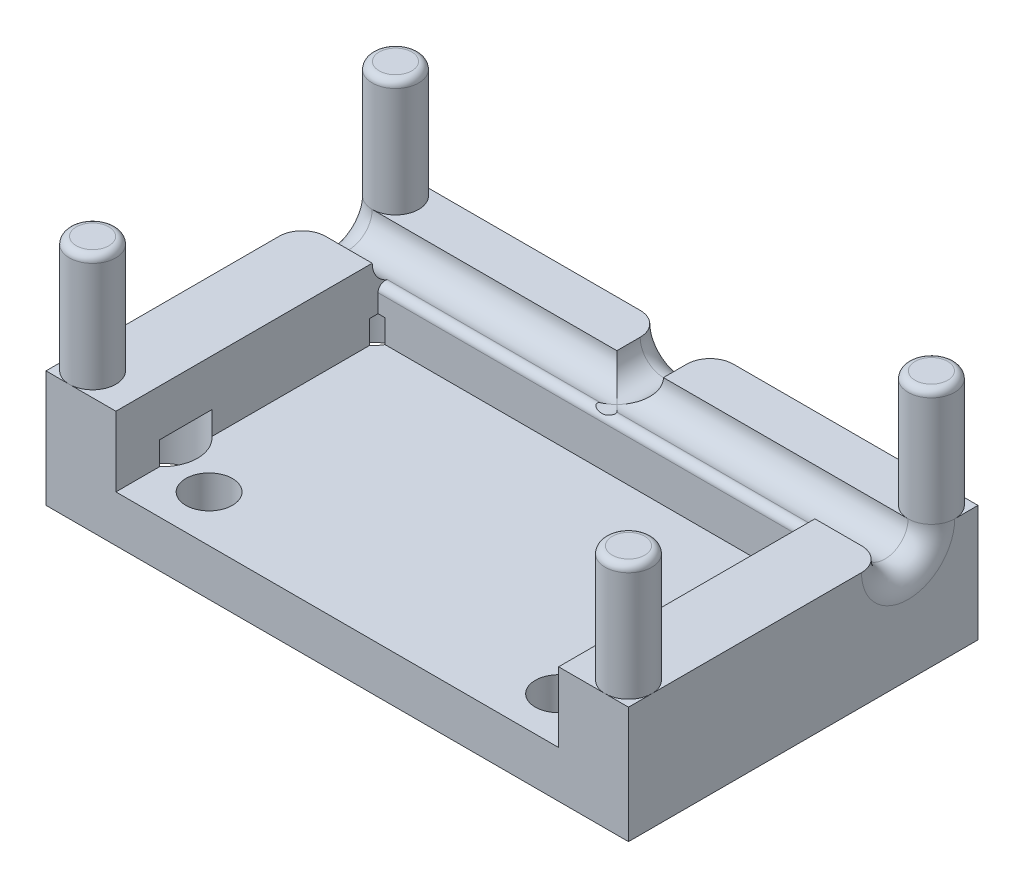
ISO-10303-21;
HEADER;
FILE_DESCRIPTION(('STEP AP214'),'2;1');
FILE_NAME('part.step','',(''),(''),'','','');
FILE_SCHEMA(('AUTOMOTIVE_DESIGN { 1 0 10303 214 1 1 1 1 }'));
ENDSEC;
DATA;
#1=APPLICATION_CONTEXT('core data for automotive mechanical design processes');
#2=APPLICATION_PROTOCOL_DEFINITION('international standard','automotive_design',2000,#1);
#3=PRODUCT_CONTEXT('',#1,'mechanical');
#4=PRODUCT('Part','Part','',(#3));
#5=PRODUCT_RELATED_PRODUCT_CATEGORY('part','',(#4));
#6=PRODUCT_DEFINITION_FORMATION('','',#4);
#7=PRODUCT_DEFINITION_CONTEXT('part definition',#1,'design');
#8=PRODUCT_DEFINITION('design','',#6,#7);
#9=PRODUCT_DEFINITION_SHAPE('','',#8);
#10=(LENGTH_UNIT() NAMED_UNIT(*) SI_UNIT(.MILLI.,.METRE.));
#11=(NAMED_UNIT(*) PLANE_ANGLE_UNIT() SI_UNIT($,.RADIAN.));
#12=(NAMED_UNIT(*) SI_UNIT($,.STERADIAN.) SOLID_ANGLE_UNIT());
#13=UNCERTAINTY_MEASURE_WITH_UNIT(LENGTH_MEASURE(1.E-05),#10,'distance_accuracy_value','');
#14=(GEOMETRIC_REPRESENTATION_CONTEXT(3) GLOBAL_UNCERTAINTY_ASSIGNED_CONTEXT((#13)) GLOBAL_UNIT_ASSIGNED_CONTEXT((#10,
#11,#12)) REPRESENTATION_CONTEXT('',''));
#15=CARTESIAN_POINT('',(0.,0.,0.));
#16=DIRECTION('',(0.,0.,1.));
#17=DIRECTION('',(1.,0.,0.));
#18=AXIS2_PLACEMENT_3D('',#15,#16,#17);
#19=CARTESIAN_POINT('',(0.,5.,0.));
#20=DIRECTION('',(0.,1.,0.));
#21=DIRECTION('',(0.,0.,1.));
#22=AXIS2_PLACEMENT_3D('',#19,#20,#21);
#23=PLANE('',#22);
#24=DIRECTION('',(-1.,0.,0.));
#25=VECTOR('',#24,1.);
#26=CARTESIAN_POINT('',(12.5,5.,-7.5));
#27=LINE('',#26,#25);
#28=CARTESIAN_POINT('',(11.5,5.,-7.5));
#29=VERTEX_POINT('',#28);
#30=CARTESIAN_POINT('',(2.,5.,-7.5));
#31=VERTEX_POINT('',#30);
#32=EDGE_CURVE('E573',#29,#31,#27,.T.);
#33=ORIENTED_EDGE('',*,*,#32,.T.);
#34=CARTESIAN_POINT('',(2.,5.,-6.5));
#35=DIRECTION('',(0.,1.,0.));
#36=DIRECTION('',(0.,0.,1.));
#37=AXIS2_PLACEMENT_3D('',#34,#35,#36);
#38=CIRCLE('',#37,1.);
#39=CARTESIAN_POINT('',(0.999999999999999,5.,-6.5));
#40=VERTEX_POINT('',#39);
#41=EDGE_CURVE('E59',#31,#40,#38,.T.);
#42=ORIENTED_EDGE('',*,*,#41,.T.);
#43=DIRECTION('',(0.,0.,-1.));
#44=VECTOR('',#43,1.);
#45=CARTESIAN_POINT('',(1.,5.,7.5));
#46=LINE('',#45,#44);
#47=CARTESIAN_POINT('',(0.999999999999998,5.,-5.5));
#48=VERTEX_POINT('',#47);
#49=EDGE_CURVE('E706',#48,#40,#46,.T.);
#50=ORIENTED_EDGE('',*,*,#49,.F.);
#51=DIRECTION('',(-1.,0.,0.));
#52=VECTOR('',#51,1.);
#53=CARTESIAN_POINT('',(12.5,5.,-5.5));
#54=LINE('',#53,#52);
#55=CARTESIAN_POINT('',(11.5,5.,-5.5));
#56=VERTEX_POINT('',#55);
#57=EDGE_CURVE('E482',#56,#48,#54,.T.);
#58=ORIENTED_EDGE('',*,*,#57,.F.);
#59=CARTESIAN_POINT('',(11.5,5.,-6.5));
#60=DIRECTION('',(0.,1.,0.));
#61=DIRECTION('',(0.,0.,-1.));
#62=AXIS2_PLACEMENT_3D('',#59,#60,#61);
#63=CIRCLE('',#62,1.);
#64=EDGE_CURVE('E550',#29,#56,#63,.T.);
#65=ORIENTED_EDGE('',*,*,#64,.F.);
#66=EDGE_LOOP('',(#33,#42,#50,#58,#65));
#67=FACE_BOUND('',#66,.T.);
#68=ADVANCED_FACE('F37',(#67),#23,.T.);
#69=CARTESIAN_POINT('',(12.5,5.,-4.5));
#70=DIRECTION('',(-1.,0.,0.));
#71=DIRECTION('',(0.,0.,1.));
#72=AXIS2_PLACEMENT_3D('',#69,#70,#71);
#73=CYLINDRICAL_SURFACE('',#72,1.);
#74=DIRECTION('',(-1.,0.,0.));
#75=VECTOR('',#74,1.);
#76=CARTESIAN_POINT('',(12.5,4.06182223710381,-4.15384615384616));
#77=LINE('',#76,#75);
#78=CARTESIAN_POINT('',(-9.5,4.06182223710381,-4.15384615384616));
#79=VERTEX_POINT('',#78);
#80=CARTESIAN_POINT('',(-0.346153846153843,4.06182223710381,-4.15384615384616));
#81=VERTEX_POINT('',#80);
#82=EDGE_CURVE('E257',#79,#81,#77,.F.);
#83=ORIENTED_EDGE('',*,*,#82,.T.);
#84=CARTESIAN_POINT('',(0.,5.,-4.5));
#85=DIRECTION('',(-0.707106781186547,0.,-0.707106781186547));
#86=DIRECTION('',(-0.707106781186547,0.,0.707106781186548));
#87=AXIS2_PLACEMENT_3D('',#84,#85,#86);
#88=ELLIPSE('',#87,1.41421356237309,1.);
#89=CARTESIAN_POINT('',(0.,4.,-4.5));
#90=VERTEX_POINT('',#89);
#91=EDGE_CURVE('E236',#81,#90,#88,.F.);
#92=ORIENTED_EDGE('',*,*,#91,.T.);
#93=CARTESIAN_POINT('',(0.,5.,-4.5));
#94=DIRECTION('',(-0.707106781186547,0.,0.707106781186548));
#95=DIRECTION('',(-0.707106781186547,0.,-0.707106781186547));
#96=AXIS2_PLACEMENT_3D('',#93,#94,#95);
#97=ELLIPSE('',#96,1.4142135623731,1.);
#98=CARTESIAN_POINT('',(-0.999999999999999,5.,-5.5));
#99=VERTEX_POINT('',#98);
#100=EDGE_CURVE('E703',#90,#99,#97,.F.);
#101=ORIENTED_EDGE('',*,*,#100,.T.);
#102=CARTESIAN_POINT('',(-11.5,5.,-5.5));
#103=VERTEX_POINT('',#102);
#104=EDGE_CURVE('E479',#99,#103,#54,.T.);
#105=ORIENTED_EDGE('',*,*,#104,.T.);
#106=CARTESIAN_POINT('',(-11.5,5.,-4.5));
#107=DIRECTION('',(1.,0.,0.));
#108=DIRECTION('',(0.,0.,-1.));
#109=AXIS2_PLACEMENT_3D('',#106,#107,#108);
#110=CIRCLE('',#109,1.);
#111=CARTESIAN_POINT('',(-11.5,5.,-3.5));
#112=VERTEX_POINT('',#111);
#113=EDGE_CURVE('E478',#103,#112,#110,.F.);
#114=ORIENTED_EDGE('',*,*,#113,.T.);
#115=DIRECTION('',(-1.,0.,0.));
#116=VECTOR('',#115,1.);
#117=CARTESIAN_POINT('',(12.5,5.,-3.5));
#118=LINE('',#117,#116);
#119=CARTESIAN_POINT('',(-9.5,5.,-3.5));
#120=VERTEX_POINT('',#119);
#121=EDGE_CURVE('E466',#112,#120,#118,.F.);
#122=ORIENTED_EDGE('',*,*,#121,.T.);
#123=CARTESIAN_POINT('',(-9.5,5.,-4.5));
#124=DIRECTION('',(-1.,0.,0.));
#125=DIRECTION('',(0.,0.,1.));
#126=AXIS2_PLACEMENT_3D('',#123,#124,#125);
#127=CIRCLE('',#126,1.);
#128=EDGE_CURVE('E476',#120,#79,#127,.F.);
#129=ORIENTED_EDGE('',*,*,#128,.T.);
#130=EDGE_LOOP('',(#83,#92,#101,#105,#114,#122,#129));
#131=FACE_BOUND('',#130,.T.);
#132=ADVANCED_FACE('F359',(#131),#73,.F.);
#133=CARTESIAN_POINT('',(-9.5,2.,7.5));
#134=DIRECTION('',(-1.,0.,0.));
#135=DIRECTION('',(0.,0.,1.));
#136=AXIS2_PLACEMENT_3D('',#133,#134,#135);
#137=PLANE('',#136);
#138=DIRECTION('',(0.,1.,0.));
#139=VECTOR('',#138,1.);
#140=CARTESIAN_POINT('',(-9.5,-1.2E-05,-3.3819660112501));
#141=LINE('',#140,#139);
#142=CARTESIAN_POINT('',(-9.5,3.,-3.3819660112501));
#143=VERTEX_POINT('',#142);
#144=CARTESIAN_POINT('',(-9.5,2.,-3.3819660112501));
#145=VERTEX_POINT('',#144);
#146=EDGE_CURVE('E664',#143,#145,#141,.F.);
#147=ORIENTED_EDGE('',*,*,#146,.F.);
#148=DIRECTION('',(0.,0.,-1.));
#149=VECTOR('',#148,1.);
#150=CARTESIAN_POINT('',(-9.5,3.,7.5));
#151=LINE('',#150,#149);
#152=CARTESIAN_POINT('',(-9.5,3.,-3.75));
#153=VERTEX_POINT('',#152);
#154=EDGE_CURVE('E654',#143,#153,#151,.T.);
#155=ORIENTED_EDGE('',*,*,#154,.T.);
#156=DIRECTION('',(0.,1.,0.));
#157=VECTOR('',#156,1.);
#158=CARTESIAN_POINT('',(-9.5,2.,-3.75));
#159=LINE('',#158,#157);
#160=CARTESIAN_POINT('',(-9.5,3.78036890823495,-3.75));
#161=VERTEX_POINT('',#160);
#162=EDGE_CURVE('E630',#153,#161,#159,.T.);
#163=ORIENTED_EDGE('',*,*,#162,.T.);
#164=CARTESIAN_POINT('',(-9.5,3.78036890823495,-4.05));
#165=DIRECTION('',(-1.,0.,0.));
#166=DIRECTION('',(0.,0.,1.));
#167=AXIS2_PLACEMENT_3D('',#164,#165,#166);
#168=CIRCLE('',#167,0.3);
#169=EDGE_CURVE('E269',#161,#79,#168,.T.);
#170=ORIENTED_EDGE('',*,*,#169,.T.);
#171=ORIENTED_EDGE('',*,*,#128,.F.);
#172=DIRECTION('',(0.,0.,1.));
#173=VECTOR('',#172,1.);
#174=CARTESIAN_POINT('',(-9.5,5.,7.5));
#175=LINE('',#174,#173);
#176=CARTESIAN_POINT('',(-9.5,5.,7.5));
#177=VERTEX_POINT('',#176);
#178=EDGE_CURVE('E464',#120,#177,#175,.T.);
#179=ORIENTED_EDGE('',*,*,#178,.T.);
#180=DIRECTION('',(0.,1.,0.));
#181=VECTOR('',#180,1.);
#182=CARTESIAN_POINT('',(-9.5,2.,7.5));
#183=LINE('',#182,#181);
#184=CARTESIAN_POINT('',(-9.5,2.,7.5));
#185=VERTEX_POINT('',#184);
#186=EDGE_CURVE('E623',#185,#177,#183,.T.);
#187=ORIENTED_EDGE('',*,*,#186,.F.);
#188=DIRECTION('',(0.,0.,1.));
#189=VECTOR('',#188,1.);
#190=CARTESIAN_POINT('',(-9.5,2.,7.5));
#191=LINE('',#190,#189);
#192=CARTESIAN_POINT('',(-9.5,2.,5.6180339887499));
#193=VERTEX_POINT('',#192);
#194=EDGE_CURVE('E632',#193,#185,#191,.T.);
#195=ORIENTED_EDGE('',*,*,#194,.F.);
#196=DIRECTION('',(0.,1.,0.));
#197=VECTOR('',#196,1.);
#198=CARTESIAN_POINT('',(-9.5,-1.2E-05,5.61803398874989));
#199=LINE('',#198,#197);
#200=CARTESIAN_POINT('',(-9.5,3.,5.6180339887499));
#201=VERTEX_POINT('',#200);
#202=EDGE_CURVE('E685',#201,#193,#199,.F.);
#203=ORIENTED_EDGE('',*,*,#202,.F.);
#204=DIRECTION('',(0.,0.,1.));
#205=VECTOR('',#204,1.);
#206=CARTESIAN_POINT('',(-9.5,3.,7.5));
#207=LINE('',#206,#205);
#208=CARTESIAN_POINT('',(-9.5,3.,3.3819660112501));
#209=VERTEX_POINT('',#208);
#210=EDGE_CURVE('E242',#209,#201,#207,.T.);
#211=ORIENTED_EDGE('',*,*,#210,.F.);
#212=DIRECTION('',(0.,1.,0.));
#213=VECTOR('',#212,1.);
#214=CARTESIAN_POINT('',(-9.5,-1.2E-05,3.38196601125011));
#215=LINE('',#214,#213);
#216=CARTESIAN_POINT('',(-9.5,2.,3.3819660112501));
#217=VERTEX_POINT('',#216);
#218=EDGE_CURVE('E687',#217,#209,#215,.T.);
#219=ORIENTED_EDGE('',*,*,#218,.F.);
#220=EDGE_CURVE('E643',#145,#217,#191,.T.);
#221=ORIENTED_EDGE('',*,*,#220,.F.);
#222=EDGE_LOOP('',(#147,#155,#163,#170,#171,#179,#187,#195,#203,#211,#219,#221));
#223=FACE_BOUND('',#222,.T.);
#224=ADVANCED_FACE('F351',(#223),#137,.F.);
#225=CARTESIAN_POINT('',(-9.5,2.,-3.75));
#226=DIRECTION('',(0.,0.,-1.));
#227=DIRECTION('',(-1.,0.,0.));
#228=AXIS2_PLACEMENT_3D('',#225,#226,#227);
#229=PLANE('',#228);
#230=DIRECTION('',(0.,1.,0.));
#231=VECTOR('',#230,1.);
#232=CARTESIAN_POINT('',(-9.20096189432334,-1.2E-05,-3.75));
#233=LINE('',#232,#231);
#234=CARTESIAN_POINT('',(-9.20096189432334,2.,-3.75));
#235=VERTEX_POINT('',#234);
#236=CARTESIAN_POINT('',(-9.20096189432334,3.,-3.75));
#237=VERTEX_POINT('',#236);
#238=EDGE_CURVE('E666',#235,#237,#233,.T.);
#239=ORIENTED_EDGE('',*,*,#238,.F.);
#240=DIRECTION('',(-1.,0.,0.));
#241=VECTOR('',#240,1.);
#242=CARTESIAN_POINT('',(-9.5,2.,-3.75));
#243=LINE('',#242,#241);
#244=CARTESIAN_POINT('',(9.20096189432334,2.,-3.75));
#245=VERTEX_POINT('',#244);
#246=EDGE_CURVE('E626',#245,#235,#243,.T.);
#247=ORIENTED_EDGE('',*,*,#246,.F.);
#248=DIRECTION('',(0.,1.,0.));
#249=VECTOR('',#248,1.);
#250=CARTESIAN_POINT('',(9.20096189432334,-1.2E-05,-3.75));
#251=LINE('',#250,#249);
#252=CARTESIAN_POINT('',(9.20096189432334,3.,-3.75));
#253=VERTEX_POINT('',#252);
#254=EDGE_CURVE('E671',#253,#245,#251,.F.);
#255=ORIENTED_EDGE('',*,*,#254,.F.);
#256=DIRECTION('',(-1.,0.,0.));
#257=VECTOR('',#256,1.);
#258=CARTESIAN_POINT('',(-9.5,3.,-3.75));
#259=LINE('',#258,#257);
#260=CARTESIAN_POINT('',(9.5,3.,-3.75));
#261=VERTEX_POINT('',#260);
#262=EDGE_CURVE('E659',#261,#253,#259,.T.);
#263=ORIENTED_EDGE('',*,*,#262,.F.);
#264=DIRECTION('',(0.,1.,0.));
#265=VECTOR('',#264,1.);
#266=CARTESIAN_POINT('',(9.5,2.,-3.75));
#267=LINE('',#266,#265);
#268=CARTESIAN_POINT('',(9.5,3.78036890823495,-3.75));
#269=VERTEX_POINT('',#268);
#270=EDGE_CURVE('E628',#261,#269,#267,.T.);
#271=ORIENTED_EDGE('',*,*,#270,.T.);
#272=DIRECTION('',(-1.,0.,0.));
#273=VECTOR('',#272,1.);
#274=CARTESIAN_POINT('',(-9.5,3.78036890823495,-3.75));
#275=LINE('',#274,#273);
#276=EDGE_CURVE('E260',#269,#161,#275,.T.);
#277=ORIENTED_EDGE('',*,*,#276,.T.);
#278=ORIENTED_EDGE('',*,*,#162,.F.);
#279=DIRECTION('',(1.,0.,0.));
#280=VECTOR('',#279,1.);
#281=CARTESIAN_POINT('',(-9.5,3.,-3.75));
#282=LINE('',#281,#280);
#283=EDGE_CURVE('E285',#153,#237,#282,.T.);
#284=ORIENTED_EDGE('',*,*,#283,.T.);
#285=EDGE_LOOP('',(#239,#247,#255,#263,#271,#277,#278,#284));
#286=FACE_BOUND('',#285,.T.);
#287=ADVANCED_FACE('F347',(#286),#229,.F.);
#288=CARTESIAN_POINT('',(9.5,2.,7.5));
#289=DIRECTION('',(1.,0.,0.));
#290=DIRECTION('',(0.,0.,-1.));
#291=AXIS2_PLACEMENT_3D('',#288,#289,#290);
#292=PLANE('',#291);
#293=DIRECTION('',(0.,1.,0.));
#294=VECTOR('',#293,1.);
#295=CARTESIAN_POINT('',(9.5,-1.2E-05,-3.3819660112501));
#296=LINE('',#295,#294);
#297=CARTESIAN_POINT('',(9.5,2.,-3.3819660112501));
#298=VERTEX_POINT('',#297);
#299=CARTESIAN_POINT('',(9.5,3.,-3.3819660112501));
#300=VERTEX_POINT('',#299);
#301=EDGE_CURVE('E673',#298,#300,#296,.T.);
#302=ORIENTED_EDGE('',*,*,#301,.F.);
#303=DIRECTION('',(0.,0.,-1.));
#304=VECTOR('',#303,1.);
#305=CARTESIAN_POINT('',(9.5,2.,7.5));
#306=LINE('',#305,#304);
#307=CARTESIAN_POINT('',(9.5,2.,3.3819660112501));
#308=VERTEX_POINT('',#307);
#309=EDGE_CURVE('E639',#308,#298,#306,.T.);
#310=ORIENTED_EDGE('',*,*,#309,.F.);
#311=DIRECTION('',(0.,1.,0.));
#312=VECTOR('',#311,1.);
#313=CARTESIAN_POINT('',(9.5,-1.2E-05,3.3819660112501));
#314=LINE('',#313,#312);
#315=CARTESIAN_POINT('',(9.5,3.,3.3819660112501));
#316=VERTEX_POINT('',#315);
#317=EDGE_CURVE('E678',#316,#308,#314,.F.);
#318=ORIENTED_EDGE('',*,*,#317,.F.);
#319=DIRECTION('',(0.,0.,1.));
#320=VECTOR('',#319,1.);
#321=CARTESIAN_POINT('',(9.5,3.,7.5));
#322=LINE('',#321,#320);
#323=CARTESIAN_POINT('',(9.5,3.,5.61803398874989));
#324=VERTEX_POINT('',#323);
#325=EDGE_CURVE('E280',#316,#324,#322,.T.);
#326=ORIENTED_EDGE('',*,*,#325,.T.);
#327=DIRECTION('',(0.,1.,0.));
#328=VECTOR('',#327,1.);
#329=CARTESIAN_POINT('',(9.5,-1.2E-05,5.61803398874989));
#330=LINE('',#329,#328);
#331=CARTESIAN_POINT('',(9.5,2.,5.61803398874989));
#332=VERTEX_POINT('',#331);
#333=EDGE_CURVE('E680',#332,#324,#330,.T.);
#334=ORIENTED_EDGE('',*,*,#333,.F.);
#335=CARTESIAN_POINT('',(9.5,2.,7.5));
#336=VERTEX_POINT('',#335);
#337=EDGE_CURVE('E636',#336,#332,#306,.T.);
#338=ORIENTED_EDGE('',*,*,#337,.F.);
#339=DIRECTION('',(0.,1.,0.));
#340=VECTOR('',#339,1.);
#341=CARTESIAN_POINT('',(9.5,2.,7.5));
#342=LINE('',#341,#340);
#343=CARTESIAN_POINT('',(9.5,5.,7.5));
#344=VERTEX_POINT('',#343);
#345=EDGE_CURVE('E625',#336,#344,#342,.T.);
#346=ORIENTED_EDGE('',*,*,#345,.T.);
#347=DIRECTION('',(0.,0.,-1.));
#348=VECTOR('',#347,1.);
#349=CARTESIAN_POINT('',(9.5,5.,7.5));
#350=LINE('',#349,#348);
#351=CARTESIAN_POINT('',(9.5,5.,-3.5));
#352=VERTEX_POINT('',#351);
#353=EDGE_CURVE('E473',#344,#352,#350,.T.);
#354=ORIENTED_EDGE('',*,*,#353,.T.);
#355=CARTESIAN_POINT('',(9.5,5.,-4.5));
#356=DIRECTION('',(1.,0.,0.));
#357=DIRECTION('',(0.,0.,-1.));
#358=AXIS2_PLACEMENT_3D('',#355,#356,#357);
#359=CIRCLE('',#358,1.);
#360=CARTESIAN_POINT('',(9.5,4.06182223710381,-4.15384615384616));
#361=VERTEX_POINT('',#360);
#362=EDGE_CURVE('E511',#361,#352,#359,.F.);
#363=ORIENTED_EDGE('',*,*,#362,.F.);
#364=CARTESIAN_POINT('',(9.5,3.78036890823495,-4.05));
#365=DIRECTION('',(1.,0.,0.));
#366=DIRECTION('',(0.,0.,-1.));
#367=AXIS2_PLACEMENT_3D('',#364,#365,#366);
#368=CIRCLE('',#367,0.3);
#369=EDGE_CURVE('E256',#361,#269,#368,.T.);
#370=ORIENTED_EDGE('',*,*,#369,.T.);
#371=ORIENTED_EDGE('',*,*,#270,.F.);
#372=DIRECTION('',(0.,0.,-1.));
#373=VECTOR('',#372,1.);
#374=CARTESIAN_POINT('',(9.5,3.,7.5));
#375=LINE('',#374,#373);
#376=EDGE_CURVE('E283',#300,#261,#375,.T.);
#377=ORIENTED_EDGE('',*,*,#376,.F.);
#378=EDGE_LOOP('',(#302,#310,#318,#326,#334,#338,#346,#354,#363,#370,#371,#377));
#379=FACE_BOUND('',#378,.T.);
#380=ADVANCED_FACE('F350',(#379),#292,.F.);
#381=ORIENTED_EDGE('',*,*,#178,.F.);
#382=ORIENTED_EDGE('',*,*,#121,.F.);
#383=CARTESIAN_POINT('',(-11.5,5.,-2.5));
#384=DIRECTION('',(0.,1.,0.));
#385=DIRECTION('',(0.,0.,1.));
#386=AXIS2_PLACEMENT_3D('',#383,#384,#385);
#387=CIRCLE('',#386,1.);
#388=CARTESIAN_POINT('',(-12.5,5.,-2.5));
#389=VERTEX_POINT('',#388);
#390=EDGE_CURVE('E491',#112,#389,#387,.T.);
#391=ORIENTED_EDGE('',*,*,#390,.T.);
#392=DIRECTION('',(0.,0.,1.));
#393=VECTOR('',#392,1.);
#394=CARTESIAN_POINT('',(-12.5,5.,7.5));
#395=LINE('',#394,#393);
#396=CARTESIAN_POINT('',(-12.5,5.,6.5));
#397=VERTEX_POINT('',#396);
#398=EDGE_CURVE('E558',#389,#397,#395,.T.);
#399=ORIENTED_EDGE('',*,*,#398,.T.);
#400=CARTESIAN_POINT('',(-11.5,5.,6.5));
#401=DIRECTION('',(0.,1.,0.));
#402=DIRECTION('',(0.,0.,-1.));
#403=AXIS2_PLACEMENT_3D('',#400,#401,#402);
#404=CIRCLE('',#403,1.);
#405=CARTESIAN_POINT('',(-11.5,5.,7.5));
#406=VERTEX_POINT('',#405);
#407=EDGE_CURVE('E620',#406,#397,#404,.T.);
#408=ORIENTED_EDGE('',*,*,#407,.F.);
#409=DIRECTION('',(1.,0.,0.));
#410=VECTOR('',#409,1.);
#411=CARTESIAN_POINT('',(12.5,5.,7.5));
#412=LINE('',#411,#410);
#413=EDGE_CURVE('E470',#406,#177,#412,.T.);
#414=ORIENTED_EDGE('',*,*,#413,.T.);
#415=EDGE_LOOP('',(#381,#382,#391,#399,#408,#414));
#416=FACE_BOUND('',#415,.T.);
#417=ADVANCED_FACE('F355',(#416),#23,.T.);
#418=CARTESIAN_POINT('',(-12.5,5.,7.5));
#419=VERTEX_POINT('',#418);
#420=EDGE_CURVE('E560',#419,#406,#412,.T.);
#421=ORIENTED_EDGE('',*,*,#420,.T.);
#422=EDGE_CURVE('E616',#397,#406,#404,.T.);
#423=ORIENTED_EDGE('',*,*,#422,.F.);
#424=EDGE_CURVE('E559',#397,#419,#395,.T.);
#425=ORIENTED_EDGE('',*,*,#424,.T.);
#426=EDGE_LOOP('',(#421,#423,#425));
#427=FACE_BOUND('',#426,.T.);
#428=ADVANCED_FACE('F454',(#427),#23,.T.);
#429=ORIENTED_EDGE('',*,*,#353,.F.);
#430=CARTESIAN_POINT('',(11.5,5.,7.5));
#431=VERTEX_POINT('',#430);
#432=EDGE_CURVE('E564',#344,#431,#412,.T.);
#433=ORIENTED_EDGE('',*,*,#432,.T.);
#434=CARTESIAN_POINT('',(11.5,5.,6.5));
#435=DIRECTION('',(0.,1.,0.));
#436=DIRECTION('',(0.,0.,1.));
#437=AXIS2_PLACEMENT_3D('',#434,#435,#436);
#438=CIRCLE('',#437,1.);
#439=CARTESIAN_POINT('',(12.5,5.,6.5));
#440=VERTEX_POINT('',#439);
#441=EDGE_CURVE('E508',#431,#440,#438,.F.);
#442=ORIENTED_EDGE('',*,*,#441,.T.);
#443=DIRECTION('',(0.,0.,-1.));
#444=VECTOR('',#443,1.);
#445=CARTESIAN_POINT('',(12.5,5.,7.5));
#446=LINE('',#445,#444);
#447=CARTESIAN_POINT('',(12.5,5.,-2.5));
#448=VERTEX_POINT('',#447);
#449=EDGE_CURVE('E569',#440,#448,#446,.T.);
#450=ORIENTED_EDGE('',*,*,#449,.T.);
#451=CARTESIAN_POINT('',(11.5,5.,-2.5));
#452=DIRECTION('',(0.,1.,0.));
#453=DIRECTION('',(0.,0.,1.));
#454=AXIS2_PLACEMENT_3D('',#451,#452,#453);
#455=CIRCLE('',#454,1.);
#456=CARTESIAN_POINT('',(11.5,5.,-3.5));
#457=VERTEX_POINT('',#456);
#458=EDGE_CURVE('E493',#448,#457,#455,.T.);
#459=ORIENTED_EDGE('',*,*,#458,.T.);
#460=EDGE_CURVE('E480',#352,#457,#118,.F.);
#461=ORIENTED_EDGE('',*,*,#460,.F.);
#462=EDGE_LOOP('',(#429,#433,#442,#450,#459,#461));
#463=FACE_BOUND('',#462,.T.);
#464=ADVANCED_FACE('F459',(#463),#23,.T.);
#465=DIRECTION('',(0.,0.,-1.));
#466=VECTOR('',#465,1.);
#467=CARTESIAN_POINT('',(-0.999999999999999,5.,7.5));
#468=LINE('',#467,#466);
#469=CARTESIAN_POINT('',(-1.,5.,-6.5));
#470=VERTEX_POINT('',#469);
#471=EDGE_CURVE('E697',#470,#99,#468,.F.);
#472=ORIENTED_EDGE('',*,*,#471,.F.);
#473=CARTESIAN_POINT('',(-2.,5.,-6.5));
#474=DIRECTION('',(0.,1.,0.));
#475=DIRECTION('',(0.,0.,1.));
#476=AXIS2_PLACEMENT_3D('',#473,#474,#475);
#477=CIRCLE('',#476,1.);
#478=CARTESIAN_POINT('',(-2.,5.,-7.5));
#479=VERTEX_POINT('',#478);
#480=EDGE_CURVE('E11',#470,#479,#477,.T.);
#481=ORIENTED_EDGE('',*,*,#480,.T.);
#482=CARTESIAN_POINT('',(-11.5,5.,-7.5));
#483=VERTEX_POINT('',#482);
#484=EDGE_CURVE('E574',#479,#483,#27,.T.);
#485=ORIENTED_EDGE('',*,*,#484,.T.);
#486=CARTESIAN_POINT('',(-11.5,5.,-6.5));
#487=DIRECTION('',(0.,1.,0.));
#488=DIRECTION('',(0.,0.,1.));
#489=AXIS2_PLACEMENT_3D('',#486,#487,#488);
#490=CIRCLE('',#489,1.);
#491=EDGE_CURVE('E540',#103,#483,#490,.T.);
#492=ORIENTED_EDGE('',*,*,#491,.F.);
#493=ORIENTED_EDGE('',*,*,#104,.F.);
#494=EDGE_LOOP('',(#472,#481,#485,#492,#493));
#495=FACE_BOUND('',#494,.T.);
#496=ADVANCED_FACE('F781',(#495),#23,.T.);
#497=CARTESIAN_POINT('',(12.5,5.,-7.5));
#498=VERTEX_POINT('',#497);
#499=EDGE_CURVE('E570',#498,#29,#27,.T.);
#500=ORIENTED_EDGE('',*,*,#499,.T.);
#501=CARTESIAN_POINT('',(12.5,5.,-6.5));
#502=VERTEX_POINT('',#501);
#503=EDGE_CURVE('E611',#502,#29,#63,.T.);
#504=ORIENTED_EDGE('',*,*,#503,.F.);
#505=EDGE_CURVE('E563',#502,#498,#446,.T.);
#506=ORIENTED_EDGE('',*,*,#505,.T.);
#507=EDGE_LOOP('',(#500,#504,#506));
#508=FACE_BOUND('',#507,.T.);
#509=ADVANCED_FACE('F610',(#508),#23,.T.);
#510=CARTESIAN_POINT('',(-12.5,5.,-7.5));
#511=VERTEX_POINT('',#510);
#512=CARTESIAN_POINT('',(-12.5,5.,-6.5));
#513=VERTEX_POINT('',#512);
#514=EDGE_CURVE('E554',#511,#513,#395,.T.);
#515=ORIENTED_EDGE('',*,*,#514,.T.);
#516=EDGE_CURVE('E542',#483,#513,#490,.T.);
#517=ORIENTED_EDGE('',*,*,#516,.F.);
#518=EDGE_CURVE('E568',#483,#511,#27,.T.);
#519=ORIENTED_EDGE('',*,*,#518,.T.);
#520=EDGE_LOOP('',(#515,#517,#519));
#521=FACE_BOUND('',#520,.T.);
#522=ADVANCED_FACE('F402',(#521),#23,.T.);
#523=CARTESIAN_POINT('',(-12.5,5.,7.5));
#524=DIRECTION('',(1.,0.,0.));
#525=DIRECTION('',(0.,0.,-1.));
#526=AXIS2_PLACEMENT_3D('',#523,#524,#525);
#527=PLANE('',#526);
#528=ORIENTED_EDGE('',*,*,#398,.F.);
#529=CARTESIAN_POINT('',(-12.5,5.,-4.5));
#530=DIRECTION('',(1.,0.,0.));
#531=DIRECTION('',(0.,0.,-1.));
#532=AXIS2_PLACEMENT_3D('',#529,#530,#531);
#533=CIRCLE('',#532,2.);
#534=EDGE_CURVE('E505',#389,#513,#533,.T.);
#535=ORIENTED_EDGE('',*,*,#534,.T.);
#536=ORIENTED_EDGE('',*,*,#514,.F.);
#537=DIRECTION('',(0.,-1.,0.));
#538=VECTOR('',#537,1.);
#539=CARTESIAN_POINT('',(-12.5,5.,-7.5));
#540=LINE('',#539,#538);
#541=CARTESIAN_POINT('',(-12.5,0.,-7.5));
#542=VERTEX_POINT('',#541);
#543=EDGE_CURVE('E572',#511,#542,#540,.T.);
#544=ORIENTED_EDGE('',*,*,#543,.T.);
#545=DIRECTION('',(0.,0.,1.));
#546=VECTOR('',#545,1.);
#547=CARTESIAN_POINT('',(-12.5,0.,7.5));
#548=LINE('',#547,#546);
#549=CARTESIAN_POINT('',(-12.5,0.,7.5));
#550=VERTEX_POINT('',#549);
#551=EDGE_CURVE('E545',#542,#550,#548,.T.);
#552=ORIENTED_EDGE('',*,*,#551,.T.);
#553=DIRECTION('',(0.,-1.,0.));
#554=VECTOR('',#553,1.);
#555=CARTESIAN_POINT('',(-12.5,5.,7.5));
#556=LINE('',#555,#554);
#557=EDGE_CURVE('E484',#419,#550,#556,.T.);
#558=ORIENTED_EDGE('',*,*,#557,.F.);
#559=ORIENTED_EDGE('',*,*,#424,.F.);
#560=EDGE_LOOP('',(#528,#535,#536,#544,#552,#558,#559));
#561=FACE_BOUND('',#560,.T.);
#562=ADVANCED_FACE('F416',(#561),#527,.F.);
#563=CARTESIAN_POINT('',(12.5,5.,7.5));
#564=DIRECTION('',(0.,0.,-1.));
#565=DIRECTION('',(-1.,0.,0.));
#566=AXIS2_PLACEMENT_3D('',#563,#564,#565);
#567=PLANE('',#566);
#568=DIRECTION('',(1.,0.,0.));
#569=VECTOR('',#568,1.);
#570=CARTESIAN_POINT('',(-9.5,2.,7.5));
#571=LINE('',#570,#569);
#572=EDGE_CURVE('E640',#185,#336,#571,.T.);
#573=ORIENTED_EDGE('',*,*,#572,.F.);
#574=ORIENTED_EDGE('',*,*,#186,.T.);
#575=ORIENTED_EDGE('',*,*,#413,.F.);
#576=ORIENTED_EDGE('',*,*,#420,.F.);
#577=ORIENTED_EDGE('',*,*,#557,.T.);
#578=DIRECTION('',(1.,0.,0.));
#579=VECTOR('',#578,1.);
#580=CARTESIAN_POINT('',(12.5,0.,7.5));
#581=LINE('',#580,#579);
#582=CARTESIAN_POINT('',(12.5,0.,7.5));
#583=VERTEX_POINT('',#582);
#584=EDGE_CURVE('E548',#550,#583,#581,.T.);
#585=ORIENTED_EDGE('',*,*,#584,.T.);
#586=DIRECTION('',(0.,-1.,0.));
#587=VECTOR('',#586,1.);
#588=CARTESIAN_POINT('',(12.5,5.,7.5));
#589=LINE('',#588,#587);
#590=CARTESIAN_POINT('',(12.5,5.,7.5));
#591=VERTEX_POINT('',#590);
#592=EDGE_CURVE('E585',#591,#583,#589,.T.);
#593=ORIENTED_EDGE('',*,*,#592,.F.);
#594=EDGE_CURVE('E557',#431,#591,#412,.T.);
#595=ORIENTED_EDGE('',*,*,#594,.F.);
#596=ORIENTED_EDGE('',*,*,#432,.F.);
#597=ORIENTED_EDGE('',*,*,#345,.F.);
#598=EDGE_LOOP('',(#573,#574,#575,#576,#577,#585,#593,#595,#596,#597));
#599=FACE_BOUND('',#598,.T.);
#600=ADVANCED_FACE('F412',(#599),#567,.F.);
#601=CARTESIAN_POINT('',(12.5,5.,7.5));
#602=DIRECTION('',(-1.,0.,0.));
#603=DIRECTION('',(0.,0.,1.));
#604=AXIS2_PLACEMENT_3D('',#601,#602,#603);
#605=PLANE('',#604);
#606=ORIENTED_EDGE('',*,*,#505,.F.);
#607=CARTESIAN_POINT('',(12.5,5.,-4.5));
#608=DIRECTION('',(-1.,0.,0.));
#609=DIRECTION('',(0.,0.,1.));
#610=AXIS2_PLACEMENT_3D('',#607,#608,#609);
#611=CIRCLE('',#610,2.);
#612=EDGE_CURVE('E488',#502,#448,#611,.T.);
#613=ORIENTED_EDGE('',*,*,#612,.T.);
#614=ORIENTED_EDGE('',*,*,#449,.F.);
#615=EDGE_CURVE('E565',#591,#440,#446,.T.);
#616=ORIENTED_EDGE('',*,*,#615,.F.);
#617=ORIENTED_EDGE('',*,*,#592,.T.);
#618=DIRECTION('',(0.,0.,-1.));
#619=VECTOR('',#618,1.);
#620=CARTESIAN_POINT('',(12.5,0.,7.5));
#621=LINE('',#620,#619);
#622=CARTESIAN_POINT('',(12.5,0.,-7.5));
#623=VERTEX_POINT('',#622);
#624=EDGE_CURVE('E577',#583,#623,#621,.T.);
#625=ORIENTED_EDGE('',*,*,#624,.T.);
#626=DIRECTION('',(0.,-1.,0.));
#627=VECTOR('',#626,1.);
#628=CARTESIAN_POINT('',(12.5,5.,-7.5));
#629=LINE('',#628,#627);
#630=EDGE_CURVE('E583',#498,#623,#629,.T.);
#631=ORIENTED_EDGE('',*,*,#630,.F.);
#632=EDGE_LOOP('',(#606,#613,#614,#616,#617,#625,#631));
#633=FACE_BOUND('',#632,.T.);
#634=ADVANCED_FACE('F408',(#633),#605,.F.);
#635=CARTESIAN_POINT('',(12.5,5.,-7.5));
#636=DIRECTION('',(0.,0.,1.));
#637=DIRECTION('',(1.,0.,0.));
#638=AXIS2_PLACEMENT_3D('',#635,#636,#637);
#639=PLANE('',#638);
#640=ORIENTED_EDGE('',*,*,#484,.F.);
#641=CARTESIAN_POINT('',(0.,5.,-7.5));
#642=DIRECTION('',(0.,0.,1.));
#643=DIRECTION('',(1.,0.,0.));
#644=AXIS2_PLACEMENT_3D('',#641,#642,#643);
#645=CIRCLE('',#644,2.);
#646=EDGE_CURVE('E241',#479,#31,#645,.T.);
#647=ORIENTED_EDGE('',*,*,#646,.T.);
#648=ORIENTED_EDGE('',*,*,#32,.F.);
#649=ORIENTED_EDGE('',*,*,#499,.F.);
#650=ORIENTED_EDGE('',*,*,#630,.T.);
#651=DIRECTION('',(-1.,0.,0.));
#652=VECTOR('',#651,1.);
#653=CARTESIAN_POINT('',(12.5,0.,-7.5));
#654=LINE('',#653,#652);
#655=EDGE_CURVE('E579',#623,#542,#654,.T.);
#656=ORIENTED_EDGE('',*,*,#655,.T.);
#657=ORIENTED_EDGE('',*,*,#543,.F.);
#658=ORIENTED_EDGE('',*,*,#518,.F.);
#659=EDGE_LOOP('',(#640,#647,#648,#649,#650,#656,#657,#658));
#660=FACE_BOUND('',#659,.T.);
#661=ADVANCED_FACE('F400',(#660),#639,.F.);
#662=ORIENTED_EDGE('',*,*,#615,.T.);
#663=CARTESIAN_POINT('',(11.5,5.,6.5));
#664=DIRECTION('',(0.,1.,0.));
#665=DIRECTION('',(0.,0.,1.));
#666=AXIS2_PLACEMENT_3D('',#663,#664,#665);
#667=CIRCLE('',#666,1.);
#668=EDGE_CURVE('E615',#431,#440,#667,.T.);
#669=ORIENTED_EDGE('',*,*,#668,.F.);
#670=ORIENTED_EDGE('',*,*,#594,.T.);
#671=EDGE_LOOP('',(#662,#669,#670));
#672=FACE_BOUND('',#671,.T.);
#673=ADVANCED_FACE('F397',(#672),#23,.T.);
#674=CARTESIAN_POINT('',(0.,0.,0.));
#675=DIRECTION('',(0.,1.,0.));
#676=DIRECTION('',(0.,0.,1.));
#677=AXIS2_PLACEMENT_3D('',#674,#675,#676);
#678=PLANE('',#677);
#679=CARTESIAN_POINT('',(-10.5,0.,-4.5));
#680=DIRECTION('',(0.,1.,0.));
#681=DIRECTION('',(0.,0.,1.));
#682=AXIS2_PLACEMENT_3D('',#679,#680,#681);
#683=CIRCLE('',#682,1.5);
#684=CARTESIAN_POINT('',(-10.5,0.,-3.));
#685=VERTEX_POINT('',#684);
#686=EDGE_CURVE('E661',#685,#685,#683,.F.);
#687=ORIENTED_EDGE('',*,*,#686,.F.);
#688=EDGE_LOOP('',(#687));
#689=FACE_BOUND('',#688,.T.);
#690=CARTESIAN_POINT('',(10.5,0.,-4.5));
#691=DIRECTION('',(0.,1.,0.));
#692=DIRECTION('',(0.,0.,1.));
#693=AXIS2_PLACEMENT_3D('',#690,#691,#692);
#694=CIRCLE('',#693,1.5);
#695=CARTESIAN_POINT('',(10.5,0.,-3.));
#696=VERTEX_POINT('',#695);
#697=EDGE_CURVE('E668',#696,#696,#694,.F.);
#698=ORIENTED_EDGE('',*,*,#697,.F.);
#699=EDGE_LOOP('',(#698));
#700=FACE_BOUND('',#699,.T.);
#701=CARTESIAN_POINT('',(10.5,0.,4.5));
#702=DIRECTION('',(0.,1.,0.));
#703=DIRECTION('',(0.,0.,1.));
#704=AXIS2_PLACEMENT_3D('',#701,#702,#703);
#705=CIRCLE('',#704,1.5);
#706=CARTESIAN_POINT('',(10.5,0.,6.));
#707=VERTEX_POINT('',#706);
#708=EDGE_CURVE('E675',#707,#707,#705,.F.);
#709=ORIENTED_EDGE('',*,*,#708,.F.);
#710=EDGE_LOOP('',(#709));
#711=FACE_BOUND('',#710,.T.);
#712=CARTESIAN_POINT('',(-10.5,0.,4.5));
#713=DIRECTION('',(0.,1.,0.));
#714=DIRECTION('',(0.,0.,1.));
#715=AXIS2_PLACEMENT_3D('',#712,#713,#714);
#716=CIRCLE('',#715,1.5);
#717=CARTESIAN_POINT('',(-10.5,0.,6.));
#718=VERTEX_POINT('',#717);
#719=EDGE_CURVE('E682',#718,#718,#716,.F.);
#720=ORIENTED_EDGE('',*,*,#719,.F.);
#721=EDGE_LOOP('',(#720));
#722=FACE_BOUND('',#721,.T.);
#723=CARTESIAN_POINT('',(-7.5,0.,5.5));
#724=DIRECTION('',(0.,1.,0.));
#725=DIRECTION('',(0.,0.,1.));
#726=AXIS2_PLACEMENT_3D('',#723,#724,#725);
#727=CIRCLE('',#726,1.);
#728=CARTESIAN_POINT('',(-7.5,0.,6.5));
#729=VERTEX_POINT('',#728);
#730=EDGE_CURVE('E474',#729,#729,#727,.T.);
#731=ORIENTED_EDGE('',*,*,#730,.T.);
#732=EDGE_LOOP('',(#731));
#733=FACE_BOUND('',#732,.T.);
#734=CARTESIAN_POINT('',(7.5,0.,5.5));
#735=DIRECTION('',(0.,1.,0.));
#736=DIRECTION('',(0.,0.,1.));
#737=AXIS2_PLACEMENT_3D('',#734,#735,#736);
#738=CIRCLE('',#737,1.);
#739=CARTESIAN_POINT('',(7.5,0.,6.5));
#740=VERTEX_POINT('',#739);
#741=EDGE_CURVE('E647',#740,#740,#738,.T.);
#742=ORIENTED_EDGE('',*,*,#741,.T.);
#743=EDGE_LOOP('',(#742));
#744=FACE_BOUND('',#743,.T.);
#745=ORIENTED_EDGE('',*,*,#551,.F.);
#746=ORIENTED_EDGE('',*,*,#655,.F.);
#747=ORIENTED_EDGE('',*,*,#624,.F.);
#748=ORIENTED_EDGE('',*,*,#584,.F.);
#749=EDGE_LOOP('',(#745,#746,#747,#748));
#750=FACE_BOUND('',#749,.T.);
#751=ADVANCED_FACE('F396',(#689,#700,#711,#722,#733,#744,#750),#678,.F.);
#752=ORIENTED_EDGE('',*,*,#57,.T.);
#753=CARTESIAN_POINT('',(0.,5.,-4.5));
#754=DIRECTION('',(-0.707106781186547,0.,-0.707106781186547));
#755=DIRECTION('',(-0.707106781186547,0.,0.707106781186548));
#756=AXIS2_PLACEMENT_3D('',#753,#754,#755);
#757=ELLIPSE('',#756,1.41421356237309,1.);
#758=EDGE_CURVE('E250',#48,#90,#757,.T.);
#759=ORIENTED_EDGE('',*,*,#758,.T.);
#760=CARTESIAN_POINT('',(0.,5.,-4.5));
#761=DIRECTION('',(-0.707106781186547,0.,0.707106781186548));
#762=DIRECTION('',(-0.707106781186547,0.,-0.707106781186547));
#763=AXIS2_PLACEMENT_3D('',#760,#761,#762);
#764=ELLIPSE('',#763,1.4142135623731,1.);
#765=CARTESIAN_POINT('',(0.346153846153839,4.06182223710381,-4.15384615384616));
#766=VERTEX_POINT('',#765);
#767=EDGE_CURVE('E233',#90,#766,#764,.T.);
#768=ORIENTED_EDGE('',*,*,#767,.T.);
#769=EDGE_CURVE('E248',#766,#361,#77,.F.);
#770=ORIENTED_EDGE('',*,*,#769,.T.);
#771=ORIENTED_EDGE('',*,*,#362,.T.);
#772=ORIENTED_EDGE('',*,*,#460,.T.);
#773=CARTESIAN_POINT('',(11.5,5.,-4.5));
#774=DIRECTION('',(-1.,0.,0.));
#775=DIRECTION('',(0.,0.,1.));
#776=AXIS2_PLACEMENT_3D('',#773,#774,#775);
#777=CIRCLE('',#776,1.);
#778=EDGE_CURVE('E497',#457,#56,#777,.F.);
#779=ORIENTED_EDGE('',*,*,#778,.T.);
#780=EDGE_LOOP('',(#752,#759,#768,#770,#771,#772,#779));
#781=FACE_BOUND('',#780,.T.);
#782=ADVANCED_FACE('F246',(#781),#73,.F.);
#783=CARTESIAN_POINT('',(11.5,5.,-4.5));
#784=DIRECTION('',(-1.,0.,0.));
#785=DIRECTION('',(0.,0.,1.));
#786=AXIS2_PLACEMENT_3D('',#783,#784,#785);
#787=TOROIDAL_SURFACE('',#786,2.,1.);
#788=CARTESIAN_POINT('',(11.5,5.,-6.5));
#789=DIRECTION('',(0.,1.,0.));
#790=DIRECTION('',(0.,0.,1.));
#791=AXIS2_PLACEMENT_3D('',#788,#789,#790);
#792=CIRCLE('',#791,1.);
#793=EDGE_CURVE('E502',#56,#502,#792,.T.);
#794=ORIENTED_EDGE('',*,*,#793,.F.);
#795=ORIENTED_EDGE('',*,*,#778,.F.);
#796=ORIENTED_EDGE('',*,*,#458,.F.);
#797=ORIENTED_EDGE('',*,*,#612,.F.);
#798=EDGE_LOOP('',(#794,#795,#796,#797));
#799=FACE_BOUND('',#798,.T.);
#800=ADVANCED_FACE('F395',(#799),#787,.T.);
#801=CARTESIAN_POINT('',(-11.5,5.,-4.5));
#802=DIRECTION('',(1.,0.,0.));
#803=DIRECTION('',(0.,0.,-1.));
#804=AXIS2_PLACEMENT_3D('',#801,#802,#803);
#805=TOROIDAL_SURFACE('',#804,2.,1.);
#806=ORIENTED_EDGE('',*,*,#390,.F.);
#807=ORIENTED_EDGE('',*,*,#113,.F.);
#808=CARTESIAN_POINT('',(-11.5,5.,-6.5));
#809=DIRECTION('',(0.,1.,0.));
#810=DIRECTION('',(0.,0.,1.));
#811=AXIS2_PLACEMENT_3D('',#808,#809,#810);
#812=CIRCLE('',#811,1.);
#813=EDGE_CURVE('E499',#513,#103,#812,.T.);
#814=ORIENTED_EDGE('',*,*,#813,.F.);
#815=ORIENTED_EDGE('',*,*,#534,.F.);
#816=EDGE_LOOP('',(#806,#807,#814,#815));
#817=FACE_BOUND('',#816,.T.);
#818=ADVANCED_FACE('F391',(#817),#805,.T.);
#819=CARTESIAN_POINT('',(-11.5,10.,-6.5));
#820=DIRECTION('',(0.,-1.,0.));
#821=DIRECTION('',(0.,0.,-1.));
#822=AXIS2_PLACEMENT_3D('',#819,#820,#821);
#823=CYLINDRICAL_SURFACE('',#822,1.);
#824=CARTESIAN_POINT('',(-11.5,9.7,-6.5));
#825=DIRECTION('',(0.,1.,0.));
#826=DIRECTION('',(0.,0.,1.));
#827=AXIS2_PLACEMENT_3D('',#824,#825,#826);
#828=CIRCLE('',#827,1.);
#829=CARTESIAN_POINT('',(-11.5,9.7,-5.5));
#830=VERTEX_POINT('',#829);
#831=EDGE_CURVE('E529',#830,#830,#828,.F.);
#832=ORIENTED_EDGE('',*,*,#831,.T.);
#833=EDGE_LOOP('',(#832));
#834=FACE_BOUND('',#833,.T.);
#835=ORIENTED_EDGE('',*,*,#491,.T.);
#836=ORIENTED_EDGE('',*,*,#516,.T.);
#837=ORIENTED_EDGE('',*,*,#813,.T.);
#838=EDGE_LOOP('',(#835,#836,#837));
#839=FACE_BOUND('',#838,.T.);
#840=ADVANCED_FACE('F387',(#834,#839),#823,.T.);
#841=CARTESIAN_POINT('',(-11.5,10.,-6.5));
#842=DIRECTION('',(0.,1.,0.));
#843=DIRECTION('',(0.,0.,1.));
#844=AXIS2_PLACEMENT_3D('',#841,#842,#843);
#845=PLANE('',#844);
#846=CARTESIAN_POINT('',(-11.5,10.,-6.5));
#847=DIRECTION('',(0.,1.,0.));
#848=DIRECTION('',(0.,0.,1.));
#849=AXIS2_PLACEMENT_3D('',#846,#847,#848);
#850=CIRCLE('',#849,0.7);
#851=CARTESIAN_POINT('',(-11.5,10.,-5.8));
#852=VERTEX_POINT('',#851);
#853=EDGE_CURVE('E526',#852,#852,#850,.T.);
#854=ORIENTED_EDGE('',*,*,#853,.T.);
#855=EDGE_LOOP('',(#854));
#856=FACE_BOUND('',#855,.T.);
#857=ADVANCED_FACE('F380',(#856),#845,.T.);
#858=CARTESIAN_POINT('',(11.5,10.,-6.5));
#859=DIRECTION('',(0.,-1.,0.));
#860=DIRECTION('',(0.,0.,-1.));
#861=AXIS2_PLACEMENT_3D('',#858,#859,#860);
#862=CYLINDRICAL_SURFACE('',#861,1.);
#863=CARTESIAN_POINT('',(11.5,9.7,-6.5));
#864=DIRECTION('',(0.,-1.,0.));
#865=DIRECTION('',(0.,0.,-1.));
#866=AXIS2_PLACEMENT_3D('',#863,#864,#865);
#867=CIRCLE('',#866,1.);
#868=CARTESIAN_POINT('',(11.5,9.7,-7.5));
#869=VERTEX_POINT('',#868);
#870=EDGE_CURVE('E523',#869,#869,#867,.T.);
#871=ORIENTED_EDGE('',*,*,#870,.T.);
#872=EDGE_LOOP('',(#871));
#873=FACE_BOUND('',#872,.T.);
#874=ORIENTED_EDGE('',*,*,#64,.T.);
#875=ORIENTED_EDGE('',*,*,#793,.T.);
#876=ORIENTED_EDGE('',*,*,#503,.T.);
#877=EDGE_LOOP('',(#874,#875,#876));
#878=FACE_BOUND('',#877,.T.);
#879=ADVANCED_FACE('F377',(#873,#878),#862,.T.);
#880=CARTESIAN_POINT('',(11.5,10.,-6.5));
#881=DIRECTION('',(0.,-1.,0.));
#882=DIRECTION('',(0.,0.,-1.));
#883=AXIS2_PLACEMENT_3D('',#880,#881,#882);
#884=PLANE('',#883);
#885=CARTESIAN_POINT('',(11.5,10.,-6.5));
#886=DIRECTION('',(0.,-1.,0.));
#887=DIRECTION('',(0.,0.,-1.));
#888=AXIS2_PLACEMENT_3D('',#885,#886,#887);
#889=CIRCLE('',#888,0.7);
#890=CARTESIAN_POINT('',(11.5,10.,-7.2));
#891=VERTEX_POINT('',#890);
#892=EDGE_CURVE('E520',#891,#891,#889,.F.);
#893=ORIENTED_EDGE('',*,*,#892,.T.);
#894=EDGE_LOOP('',(#893));
#895=FACE_BOUND('',#894,.T.);
#896=ADVANCED_FACE('F372',(#895),#884,.F.);
#897=CARTESIAN_POINT('',(11.5,10.,6.5));
#898=DIRECTION('',(0.,-1.,0.));
#899=DIRECTION('',(0.,0.,-1.));
#900=AXIS2_PLACEMENT_3D('',#897,#898,#899);
#901=CYLINDRICAL_SURFACE('',#900,1.);
#902=CARTESIAN_POINT('',(11.5,9.7,6.5));
#903=DIRECTION('',(0.,1.,0.));
#904=DIRECTION('',(0.,0.,1.));
#905=AXIS2_PLACEMENT_3D('',#902,#903,#904);
#906=CIRCLE('',#905,1.);
#907=CARTESIAN_POINT('',(11.5,9.7,7.5));
#908=VERTEX_POINT('',#907);
#909=EDGE_CURVE('E517',#908,#908,#906,.F.);
#910=ORIENTED_EDGE('',*,*,#909,.T.);
#911=EDGE_LOOP('',(#910));
#912=FACE_BOUND('',#911,.T.);
#913=ORIENTED_EDGE('',*,*,#668,.T.);
#914=ORIENTED_EDGE('',*,*,#441,.F.);
#915=EDGE_LOOP('',(#913,#914));
#916=FACE_BOUND('',#915,.T.);
#917=ADVANCED_FACE('F369',(#912,#916),#901,.T.);
#918=CARTESIAN_POINT('',(11.5,10.,6.5));
#919=DIRECTION('',(0.,1.,0.));
#920=DIRECTION('',(0.,0.,1.));
#921=AXIS2_PLACEMENT_3D('',#918,#919,#920);
#922=PLANE('',#921);
#923=CARTESIAN_POINT('',(11.5,10.,6.5));
#924=DIRECTION('',(0.,1.,0.));
#925=DIRECTION('',(0.,0.,1.));
#926=AXIS2_PLACEMENT_3D('',#923,#924,#925);
#927=CIRCLE('',#926,0.7);
#928=CARTESIAN_POINT('',(11.5,10.,7.2));
#929=VERTEX_POINT('',#928);
#930=EDGE_CURVE('E514',#929,#929,#927,.T.);
#931=ORIENTED_EDGE('',*,*,#930,.T.);
#932=EDGE_LOOP('',(#931));
#933=FACE_BOUND('',#932,.T.);
#934=ADVANCED_FACE('F364',(#933),#922,.T.);
#935=CARTESIAN_POINT('',(-11.5,10.,6.5));
#936=DIRECTION('',(0.,-1.,0.));
#937=DIRECTION('',(0.,0.,-1.));
#938=AXIS2_PLACEMENT_3D('',#935,#936,#937);
#939=CYLINDRICAL_SURFACE('',#938,1.);
#940=CARTESIAN_POINT('',(-11.5,9.7,6.5));
#941=DIRECTION('',(0.,-1.,0.));
#942=DIRECTION('',(0.,0.,-1.));
#943=AXIS2_PLACEMENT_3D('',#940,#941,#942);
#944=CIRCLE('',#943,1.);
#945=CARTESIAN_POINT('',(-11.5,9.7,5.5));
#946=VERTEX_POINT('',#945);
#947=EDGE_CURVE('E258',#946,#946,#944,.T.);
#948=ORIENTED_EDGE('',*,*,#947,.T.);
#949=EDGE_LOOP('',(#948));
#950=FACE_BOUND('',#949,.T.);
#951=ORIENTED_EDGE('',*,*,#422,.T.);
#952=ORIENTED_EDGE('',*,*,#407,.T.);
#953=EDGE_LOOP('',(#951,#952));
#954=FACE_BOUND('',#953,.T.);
#955=ADVANCED_FACE('F361',(#950,#954),#939,.T.);
#956=CARTESIAN_POINT('',(-11.5,10.,6.5));
#957=DIRECTION('',(0.,-1.,0.));
#958=DIRECTION('',(0.,0.,-1.));
#959=AXIS2_PLACEMENT_3D('',#956,#957,#958);
#960=PLANE('',#959);
#961=CARTESIAN_POINT('',(-11.5,10.,6.5));
#962=DIRECTION('',(0.,-1.,0.));
#963=DIRECTION('',(0.,0.,-1.));
#964=AXIS2_PLACEMENT_3D('',#961,#962,#963);
#965=CIRCLE('',#964,0.7);
#966=CARTESIAN_POINT('',(-11.5,10.,5.8));
#967=VERTEX_POINT('',#966);
#968=EDGE_CURVE('E262',#967,#967,#965,.F.);
#969=ORIENTED_EDGE('',*,*,#968,.T.);
#970=EDGE_LOOP('',(#969));
#971=FACE_BOUND('',#970,.T.);
#972=ADVANCED_FACE('F345',(#971),#960,.F.);
#973=CARTESIAN_POINT('',(0.,2.,0.));
#974=DIRECTION('',(0.,-1.,0.));
#975=DIRECTION('',(0.,0.,-1.));
#976=AXIS2_PLACEMENT_3D('',#973,#974,#975);
#977=PLANE('',#976);
#978=CARTESIAN_POINT('',(-10.5,2.,-4.5));
#979=DIRECTION('',(0.,-1.,0.));
#980=DIRECTION('',(0.,0.,-1.));
#981=AXIS2_PLACEMENT_3D('',#978,#979,#980);
#982=CIRCLE('',#981,1.5);
#983=EDGE_CURVE('E278',#145,#235,#982,.F.);
#984=ORIENTED_EDGE('',*,*,#983,.F.);
#985=ORIENTED_EDGE('',*,*,#220,.T.);
#986=CARTESIAN_POINT('',(-10.5,2.,4.5));
#987=DIRECTION('',(0.,-1.,0.));
#988=DIRECTION('',(0.,0.,-1.));
#989=AXIS2_PLACEMENT_3D('',#986,#987,#988);
#990=CIRCLE('',#989,1.5);
#991=EDGE_CURVE('E272',#193,#217,#990,.F.);
#992=ORIENTED_EDGE('',*,*,#991,.F.);
#993=ORIENTED_EDGE('',*,*,#194,.T.);
#994=ORIENTED_EDGE('',*,*,#572,.T.);
#995=ORIENTED_EDGE('',*,*,#337,.T.);
#996=CARTESIAN_POINT('',(10.5,2.,4.5));
#997=DIRECTION('',(0.,-1.,0.));
#998=DIRECTION('',(0.,0.,-1.));
#999=AXIS2_PLACEMENT_3D('',#996,#997,#998);
#1000=CIRCLE('',#999,1.5);
#1001=EDGE_CURVE('E274',#308,#332,#1000,.F.);
#1002=ORIENTED_EDGE('',*,*,#1001,.F.);
#1003=ORIENTED_EDGE('',*,*,#309,.T.);
#1004=CARTESIAN_POINT('',(10.5,2.,-4.5));
#1005=DIRECTION('',(0.,-1.,0.));
#1006=DIRECTION('',(0.,0.,-1.));
#1007=AXIS2_PLACEMENT_3D('',#1004,#1005,#1006);
#1008=CIRCLE('',#1007,1.5);
#1009=EDGE_CURVE('E276',#245,#298,#1008,.F.);
#1010=ORIENTED_EDGE('',*,*,#1009,.F.);
#1011=ORIENTED_EDGE('',*,*,#246,.T.);
#1012=EDGE_LOOP('',(#984,#985,#992,#993,#994,#995,#1002,#1003,#1010,#1011));
#1013=FACE_BOUND('',#1012,.T.);
#1014=CARTESIAN_POINT('',(-7.5,2.,5.5));
#1015=DIRECTION('',(0.,1.,0.));
#1016=DIRECTION('',(0.,0.,1.));
#1017=AXIS2_PLACEMENT_3D('',#1014,#1015,#1016);
#1018=CIRCLE('',#1017,1.);
#1019=CARTESIAN_POINT('',(-7.5,2.,6.5));
#1020=VERTEX_POINT('',#1019);
#1021=EDGE_CURVE('E650',#1020,#1020,#1018,.T.);
#1022=ORIENTED_EDGE('',*,*,#1021,.F.);
#1023=EDGE_LOOP('',(#1022));
#1024=FACE_BOUND('',#1023,.T.);
#1025=CARTESIAN_POINT('',(7.5,2.,5.5));
#1026=DIRECTION('',(0.,1.,0.));
#1027=DIRECTION('',(0.,0.,-1.));
#1028=AXIS2_PLACEMENT_3D('',#1025,#1026,#1027);
#1029=CIRCLE('',#1028,1.);
#1030=CARTESIAN_POINT('',(7.5,2.,4.5));
#1031=VERTEX_POINT('',#1030);
#1032=EDGE_CURVE('E651',#1031,#1031,#1029,.T.);
#1033=ORIENTED_EDGE('',*,*,#1032,.F.);
#1034=EDGE_LOOP('',(#1033));
#1035=FACE_BOUND('',#1034,.T.);
#1036=ADVANCED_FACE('F341',(#1013,#1024,#1035),#977,.F.);
#1037=CARTESIAN_POINT('',(7.5,-1.,5.5));
#1038=DIRECTION('',(0.,1.,0.));
#1039=DIRECTION('',(0.,0.,1.));
#1040=AXIS2_PLACEMENT_3D('',#1037,#1038,#1039);
#1041=CYLINDRICAL_SURFACE('',#1040,1.);
#1042=ORIENTED_EDGE('',*,*,#1032,.T.);
#1043=EDGE_LOOP('',(#1042));
#1044=FACE_BOUND('',#1043,.T.);
#1045=ORIENTED_EDGE('',*,*,#741,.F.);
#1046=EDGE_LOOP('',(#1045));
#1047=FACE_BOUND('',#1046,.T.);
#1048=ADVANCED_FACE('F337',(#1044,#1047),#1041,.F.);
#1049=CARTESIAN_POINT('',(-7.5,-1.,5.5));
#1050=DIRECTION('',(0.,1.,0.));
#1051=DIRECTION('',(0.,0.,1.));
#1052=AXIS2_PLACEMENT_3D('',#1049,#1050,#1051);
#1053=CYLINDRICAL_SURFACE('',#1052,1.);
#1054=ORIENTED_EDGE('',*,*,#1021,.T.);
#1055=EDGE_LOOP('',(#1054));
#1056=FACE_BOUND('',#1055,.T.);
#1057=ORIENTED_EDGE('',*,*,#730,.F.);
#1058=EDGE_LOOP('',(#1057));
#1059=FACE_BOUND('',#1058,.T.);
#1060=ADVANCED_FACE('F333',(#1056,#1059),#1053,.F.);
#1061=CARTESIAN_POINT('',(11.5,9.7,6.5));
#1062=DIRECTION('',(0.,1.,0.));
#1063=DIRECTION('',(0.,0.,1.));
#1064=AXIS2_PLACEMENT_3D('',#1061,#1062,#1063);
#1065=TOROIDAL_SURFACE('',#1064,0.7,0.3);
#1066=ORIENTED_EDGE('',*,*,#909,.F.);
#1067=EDGE_LOOP('',(#1066));
#1068=FACE_BOUND('',#1067,.T.);
#1069=ORIENTED_EDGE('',*,*,#930,.F.);
#1070=EDGE_LOOP('',(#1069));
#1071=FACE_BOUND('',#1070,.T.);
#1072=ADVANCED_FACE('F336',(#1068,#1071),#1065,.T.);
#1073=CARTESIAN_POINT('',(11.5,9.7,-6.5));
#1074=DIRECTION('',(0.,-1.,0.));
#1075=DIRECTION('',(0.,0.,-1.));
#1076=AXIS2_PLACEMENT_3D('',#1073,#1074,#1075);
#1077=TOROIDAL_SURFACE('',#1076,0.7,0.3);
#1078=ORIENTED_EDGE('',*,*,#870,.F.);
#1079=EDGE_LOOP('',(#1078));
#1080=FACE_BOUND('',#1079,.T.);
#1081=ORIENTED_EDGE('',*,*,#892,.F.);
#1082=EDGE_LOOP('',(#1081));
#1083=FACE_BOUND('',#1082,.T.);
#1084=ADVANCED_FACE('F429',(#1080,#1083),#1077,.T.);
#1085=CARTESIAN_POINT('',(-11.5,9.7,-6.5));
#1086=DIRECTION('',(0.,1.,0.));
#1087=DIRECTION('',(0.,0.,1.));
#1088=AXIS2_PLACEMENT_3D('',#1085,#1086,#1087);
#1089=TOROIDAL_SURFACE('',#1088,0.7,0.3);
#1090=ORIENTED_EDGE('',*,*,#831,.F.);
#1091=EDGE_LOOP('',(#1090));
#1092=FACE_BOUND('',#1091,.T.);
#1093=ORIENTED_EDGE('',*,*,#853,.F.);
#1094=EDGE_LOOP('',(#1093));
#1095=FACE_BOUND('',#1094,.T.);
#1096=ADVANCED_FACE('F433',(#1092,#1095),#1089,.T.);
#1097=CARTESIAN_POINT('',(-11.5,9.7,6.5));
#1098=DIRECTION('',(0.,-1.,0.));
#1099=DIRECTION('',(0.,0.,-1.));
#1100=AXIS2_PLACEMENT_3D('',#1097,#1098,#1099);
#1101=TOROIDAL_SURFACE('',#1100,0.7,0.3);
#1102=ORIENTED_EDGE('',*,*,#947,.F.);
#1103=EDGE_LOOP('',(#1102));
#1104=FACE_BOUND('',#1103,.T.);
#1105=ORIENTED_EDGE('',*,*,#968,.F.);
#1106=EDGE_LOOP('',(#1105));
#1107=FACE_BOUND('',#1106,.T.);
#1108=ADVANCED_FACE('F436',(#1104,#1107),#1101,.T.);
#1109=CARTESIAN_POINT('',(12.5,3.78036890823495,-4.05));
#1110=DIRECTION('',(-1.,0.,0.));
#1111=DIRECTION('',(0.,0.,1.));
#1112=AXIS2_PLACEMENT_3D('',#1109,#1110,#1111);
#1113=CYLINDRICAL_SURFACE('',#1112,0.3);
#1114=CARTESIAN_POINT('',(-0.346153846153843,4.06182223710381,-4.15384615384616));
#1115=CARTESIAN_POINT('',(-0.352326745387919,4.06409718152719,-4.14768126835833));
#1116=CARTESIAN_POINT('',(-0.358130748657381,4.06631075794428,-4.14105677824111));
#1117=CARTESIAN_POINT('',(-0.368731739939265,4.070447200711,-4.12687416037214));
#1118=CARTESIAN_POINT('',(-0.373519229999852,4.07236728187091,-4.11930819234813));
#1119=CARTESIAN_POINT('',(-0.380853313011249,4.07535770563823,-4.10498561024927));
#1120=CARTESIAN_POINT('',(-0.383658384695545,4.07652161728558,-4.09838347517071));
#1121=CARTESIAN_POINT('',(-0.388205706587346,4.07842395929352,-4.08478586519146));
#1122=CARTESIAN_POINT('',(-0.389951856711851,4.07916395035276,-4.07779193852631));
#1123=CARTESIAN_POINT('',(-0.392271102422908,4.08014942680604,-4.06352753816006));
#1124=CARTESIAN_POINT('',(-0.392836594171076,4.08039170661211,-4.05625557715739));
#1125=CARTESIAN_POINT('',(-0.392721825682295,4.08034268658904,-4.04171762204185));
#1126=CARTESIAN_POINT('',(-0.392040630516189,4.08005098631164,-4.03445163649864));
#1127=CARTESIAN_POINT('',(-0.38959620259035,4.0790134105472,-4.02076412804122));
#1128=CARTESIAN_POINT('',(-0.387926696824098,4.07830691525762,-4.01432233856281));
#1129=CARTESIAN_POINT('',(-0.383697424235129,4.07653829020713,-4.00179434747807));
#1130=CARTESIAN_POINT('',(-0.38113752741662,4.07547610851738,-3.99570819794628));
#1131=CARTESIAN_POINT('',(-0.374066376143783,4.07258744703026,-3.98159553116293));
#1132=CARTESIAN_POINT('',(-0.369184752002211,4.07062568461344,-3.97378249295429));
#1133=CARTESIAN_POINT('',(-0.358283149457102,4.06636855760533,-3.9590991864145));
#1134=CARTESIAN_POINT('',(-0.352260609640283,4.06407244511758,-3.95223110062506));
#1135=CARTESIAN_POINT('',(-0.336054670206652,4.05810067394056,-3.93610140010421));
#1136=CARTESIAN_POINT('',(-0.325325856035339,4.05432358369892,-3.92742893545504));
#1137=CARTESIAN_POINT('',(-0.302639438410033,4.04681897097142,-3.91187446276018));
#1138=CARTESIAN_POINT('',(-0.29067920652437,4.04309157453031,-3.90499640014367));
#1139=CARTESIAN_POINT('',(-0.257251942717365,4.03340899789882,-3.8883837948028));
#1140=CARTESIAN_POINT('',(-0.235016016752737,4.0277312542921,-3.88004363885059));
#1141=CARTESIAN_POINT('',(-0.189330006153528,4.01780449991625,-3.86644406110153));
#1142=CARTESIAN_POINT('',(-0.165876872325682,4.01355929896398,-3.86119282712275));
#1143=CARTESIAN_POINT('',(-0.106226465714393,4.00500040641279,-3.85098149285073));
#1144=CARTESIAN_POINT('',(-0.0696152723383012,4.00175039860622,-3.84752834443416));
#1145=CARTESIAN_POINT('',(0.00389791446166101,3.99932958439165,-3.84491948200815));
#1146=CARTESIAN_POINT('',(0.0408001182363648,4.00016206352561,-3.84576722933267));
#1147=CARTESIAN_POINT('',(0.105432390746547,4.00517339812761,-3.85132473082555));
#1148=CARTESIAN_POINT('',(0.133309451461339,4.00853357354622,-3.85509570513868));
#1149=CARTESIAN_POINT('',(0.188005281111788,4.01744593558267,-3.86602417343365));
#1150=CARTESIAN_POINT('',(0.214827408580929,4.02299041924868,-3.8731697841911));
#1151=CARTESIAN_POINT('',(0.253832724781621,4.03265408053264,-3.88756447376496));
#1152=CARTESIAN_POINT('',(0.266807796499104,4.03616075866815,-3.89308330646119));
#1153=CARTESIAN_POINT('',(0.29191978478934,4.04346857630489,-3.90566664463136));
#1154=CARTESIAN_POINT('',(0.304056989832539,4.04726961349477,-3.91273061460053));
#1155=CARTESIAN_POINT('',(0.324591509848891,4.05409735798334,-3.92703145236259));
#1156=CARTESIAN_POINT('',(0.333235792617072,4.05711715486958,-3.93391329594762));
#1157=CARTESIAN_POINT('',(0.349358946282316,4.06297209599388,-3.94900152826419));
#1158=CARTESIAN_POINT('',(0.356840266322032,4.0658076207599,-3.95720505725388));
#1159=CARTESIAN_POINT('',(0.368113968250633,4.0702058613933,-3.9723075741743));
#1160=CARTESIAN_POINT('',(0.372336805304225,4.07189367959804,-3.97884677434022));
#1161=CARTESIAN_POINT('',(0.379753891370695,4.07490379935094,-3.99256834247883));
#1162=CARTESIAN_POINT('',(0.382948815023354,4.07622634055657,-3.99975028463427));
#1163=CARTESIAN_POINT('',(0.388108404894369,4.07838189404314,-4.014704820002));
#1164=CARTESIAN_POINT('',(0.390060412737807,4.0792098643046,-4.02248261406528));
#1165=CARTESIAN_POINT('',(0.392495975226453,4.08024524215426,-4.03830505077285));
#1166=CARTESIAN_POINT('',(0.39298093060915,4.08045324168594,-4.04634943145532));
#1167=CARTESIAN_POINT('',(0.392476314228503,4.08023792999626,-4.06121585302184));
#1168=CARTESIAN_POINT('',(0.391689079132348,4.07990124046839,-4.06804705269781));
#1169=CARTESIAN_POINT('',(0.389068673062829,4.07879016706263,-4.08146560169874));
#1170=CARTESIAN_POINT('',(0.38723552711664,4.07801579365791,-4.08805295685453));
#1171=CARTESIAN_POINT('',(0.382636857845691,4.07609783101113,-4.10085796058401));
#1172=CARTESIAN_POINT('',(0.379868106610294,4.07495296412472,-4.10707424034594));
#1173=CARTESIAN_POINT('',(0.373547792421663,4.07238287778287,-4.11903189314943));
#1174=CARTESIAN_POINT('',(0.369995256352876,4.07095731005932,-4.12477266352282));
#1175=CARTESIAN_POINT('',(0.360148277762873,4.06708241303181,-4.13872632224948));
#1176=CARTESIAN_POINT('',(0.353410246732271,4.06449647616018,-4.14659633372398));
#1177=CARTESIAN_POINT('',(0.346153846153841,4.06182223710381,-4.15384615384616));
#1178=B_SPLINE_CURVE_WITH_KNOTS('',3,(#1114,#1115,#1116,#1117,#1118,#1119,#1120,#1121,#1122,
#1123,#1124,#1125,#1126,#1127,#1128,#1129,#1130,#1131,#1132,#1133,#1134,#1135,#1136,#1137,#1138,
#1139,#1140,#1141,#1142,#1143,#1144,#1145,#1146,#1147,#1148,#1149,#1150,#1151,#1152,#1153,#1154,
#1155,#1156,#1157,#1158,#1159,#1160,#1161,#1162,#1163,#1164,#1165,#1166,#1167,#1168,#1169,#1170,
#1171,#1172,#1173,#1174,#1175,#1176,#1177),.UNSPECIFIED.,.F.,.F.,(4,2,2,2,2,2,2,2,2,2,2,2,2,2,2,
2,2,2,2,2,2,2,2,2,2,2,2,2,2,2,2,4),(0.,0.0271024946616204,0.0544480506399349,0.0761588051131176,
0.0977891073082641,0.119558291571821,0.141343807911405,0.161335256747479,0.181329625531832,
0.209428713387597,0.237591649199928,0.280259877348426,0.32302114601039,0.395864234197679,
0.468899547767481,0.579087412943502,0.68936397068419,0.774129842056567,0.858599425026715,
0.902110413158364,0.945606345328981,0.979868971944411,1.01405843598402,1.03787074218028,
1.06166738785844,1.0857026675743,1.10971499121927,1.130268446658,1.15082141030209,
1.17144601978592,1.19209638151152,1.22391902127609),.UNSPECIFIED.);
#1179=EDGE_CURVE('E230',#81,#766,#1178,.T.);
#1180=ORIENTED_EDGE('',*,*,#1179,.F.);
#1181=ORIENTED_EDGE('',*,*,#82,.F.);
#1182=ORIENTED_EDGE('',*,*,#169,.F.);
#1183=ORIENTED_EDGE('',*,*,#276,.F.);
#1184=ORIENTED_EDGE('',*,*,#369,.F.);
#1185=ORIENTED_EDGE('',*,*,#769,.F.);
#1186=EDGE_LOOP('',(#1180,#1181,#1182,#1183,#1184,#1185));
#1187=FACE_BOUND('',#1186,.T.);
#1188=ADVANCED_FACE('F253',(#1187),#1113,.T.);
#1189=CARTESIAN_POINT('',(-10.5,3.,4.5));
#1190=DIRECTION('',(0.,-1.,0.));
#1191=DIRECTION('',(0.,0.,-1.));
#1192=AXIS2_PLACEMENT_3D('',#1189,#1190,#1191);
#1193=PLANE('',#1192);
#1194=ORIENTED_EDGE('',*,*,#210,.T.);
#1195=CARTESIAN_POINT('',(-10.5,3.,4.5));
#1196=DIRECTION('',(0.,-1.,0.));
#1197=DIRECTION('',(0.,0.,-1.));
#1198=AXIS2_PLACEMENT_3D('',#1195,#1196,#1197);
#1199=CIRCLE('',#1198,1.5);
#1200=EDGE_CURVE('E689',#201,#209,#1199,.T.);
#1201=ORIENTED_EDGE('',*,*,#1200,.T.);
#1202=EDGE_LOOP('',(#1194,#1201));
#1203=FACE_BOUND('',#1202,.T.);
#1204=ADVANCED_FACE('F326',(#1203),#1193,.T.);
#1205=CARTESIAN_POINT('',(-10.5,-1.2E-05,4.5));
#1206=DIRECTION('',(0.,1.,0.));
#1207=DIRECTION('',(0.,0.,1.));
#1208=AXIS2_PLACEMENT_3D('',#1205,#1206,#1207);
#1209=CYLINDRICAL_SURFACE('',#1208,1.5);
#1210=ORIENTED_EDGE('',*,*,#202,.T.);
#1211=ORIENTED_EDGE('',*,*,#991,.T.);
#1212=ORIENTED_EDGE('',*,*,#218,.T.);
#1213=ORIENTED_EDGE('',*,*,#1200,.F.);
#1214=EDGE_LOOP('',(#1210,#1211,#1212,#1213));
#1215=FACE_BOUND('',#1214,.T.);
#1216=ORIENTED_EDGE('',*,*,#719,.T.);
#1217=EDGE_LOOP('',(#1216));
#1218=FACE_BOUND('',#1217,.T.);
#1219=ADVANCED_FACE('F309',(#1215,#1218),#1209,.F.);
#1220=CARTESIAN_POINT('',(10.5,3.,4.5));
#1221=DIRECTION('',(0.,1.,0.));
#1222=DIRECTION('',(0.,0.,1.));
#1223=AXIS2_PLACEMENT_3D('',#1220,#1221,#1222);
#1224=PLANE('',#1223);
#1225=CARTESIAN_POINT('',(10.5,3.,4.5));
#1226=DIRECTION('',(0.,-1.,0.));
#1227=DIRECTION('',(0.,0.,1.));
#1228=AXIS2_PLACEMENT_3D('',#1225,#1226,#1227);
#1229=CIRCLE('',#1228,1.5);
#1230=EDGE_CURVE('E692',#316,#324,#1229,.T.);
#1231=ORIENTED_EDGE('',*,*,#1230,.T.);
#1232=ORIENTED_EDGE('',*,*,#325,.F.);
#1233=EDGE_LOOP('',(#1231,#1232));
#1234=FACE_BOUND('',#1233,.T.);
#1235=ADVANCED_FACE('F305',(#1234),#1224,.F.);
#1236=CARTESIAN_POINT('',(10.5,-1.2E-05,4.5));
#1237=DIRECTION('',(0.,1.,0.));
#1238=DIRECTION('',(0.,0.,1.));
#1239=AXIS2_PLACEMENT_3D('',#1236,#1237,#1238);
#1240=CYLINDRICAL_SURFACE('',#1239,1.5);
#1241=ORIENTED_EDGE('',*,*,#317,.T.);
#1242=ORIENTED_EDGE('',*,*,#1001,.T.);
#1243=ORIENTED_EDGE('',*,*,#333,.T.);
#1244=ORIENTED_EDGE('',*,*,#1230,.F.);
#1245=EDGE_LOOP('',(#1241,#1242,#1243,#1244));
#1246=FACE_BOUND('',#1245,.T.);
#1247=ORIENTED_EDGE('',*,*,#708,.T.);
#1248=EDGE_LOOP('',(#1247));
#1249=FACE_BOUND('',#1248,.T.);
#1250=ADVANCED_FACE('F301',(#1246,#1249),#1240,.F.);
#1251=CARTESIAN_POINT('',(10.5,3.,-4.5));
#1252=DIRECTION('',(0.,-1.,0.));
#1253=DIRECTION('',(0.,0.,-1.));
#1254=AXIS2_PLACEMENT_3D('',#1251,#1252,#1253);
#1255=PLANE('',#1254);
#1256=ORIENTED_EDGE('',*,*,#262,.T.);
#1257=CARTESIAN_POINT('',(10.5,3.,-4.5));
#1258=DIRECTION('',(0.,-1.,0.));
#1259=DIRECTION('',(0.,0.,-1.));
#1260=AXIS2_PLACEMENT_3D('',#1257,#1258,#1259);
#1261=CIRCLE('',#1260,1.5);
#1262=EDGE_CURVE('E696',#253,#300,#1261,.T.);
#1263=ORIENTED_EDGE('',*,*,#1262,.T.);
#1264=ORIENTED_EDGE('',*,*,#376,.T.);
#1265=EDGE_LOOP('',(#1256,#1263,#1264));
#1266=FACE_BOUND('',#1265,.T.);
#1267=ADVANCED_FACE('F304',(#1266),#1255,.T.);
#1268=CARTESIAN_POINT('',(10.5,-1.2E-05,-4.5));
#1269=DIRECTION('',(0.,1.,0.));
#1270=DIRECTION('',(0.,0.,1.));
#1271=AXIS2_PLACEMENT_3D('',#1268,#1269,#1270);
#1272=CYLINDRICAL_SURFACE('',#1271,1.5);
#1273=ORIENTED_EDGE('',*,*,#254,.T.);
#1274=ORIENTED_EDGE('',*,*,#1009,.T.);
#1275=ORIENTED_EDGE('',*,*,#301,.T.);
#1276=ORIENTED_EDGE('',*,*,#1262,.F.);
#1277=EDGE_LOOP('',(#1273,#1274,#1275,#1276));
#1278=FACE_BOUND('',#1277,.T.);
#1279=ORIENTED_EDGE('',*,*,#697,.T.);
#1280=EDGE_LOOP('',(#1279));
#1281=FACE_BOUND('',#1280,.T.);
#1282=ADVANCED_FACE('F311',(#1278,#1281),#1272,.F.);
#1283=CARTESIAN_POINT('',(-10.5,3.,-4.5));
#1284=DIRECTION('',(0.,1.,0.));
#1285=DIRECTION('',(0.,0.,1.));
#1286=AXIS2_PLACEMENT_3D('',#1283,#1284,#1285);
#1287=PLANE('',#1286);
#1288=CARTESIAN_POINT('',(-10.5,3.,-4.5));
#1289=DIRECTION('',(0.,-1.,0.));
#1290=DIRECTION('',(0.,0.,1.));
#1291=AXIS2_PLACEMENT_3D('',#1288,#1289,#1290);
#1292=CIRCLE('',#1291,1.5);
#1293=EDGE_CURVE('E693',#143,#237,#1292,.T.);
#1294=ORIENTED_EDGE('',*,*,#1293,.T.);
#1295=ORIENTED_EDGE('',*,*,#283,.F.);
#1296=ORIENTED_EDGE('',*,*,#154,.F.);
#1297=EDGE_LOOP('',(#1294,#1295,#1296));
#1298=FACE_BOUND('',#1297,.T.);
#1299=ADVANCED_FACE('F314',(#1298),#1287,.F.);
#1300=CARTESIAN_POINT('',(-10.5,-1.2E-05,-4.5));
#1301=DIRECTION('',(0.,1.,0.));
#1302=DIRECTION('',(0.,0.,1.));
#1303=AXIS2_PLACEMENT_3D('',#1300,#1301,#1302);
#1304=CYLINDRICAL_SURFACE('',#1303,1.5);
#1305=ORIENTED_EDGE('',*,*,#146,.T.);
#1306=ORIENTED_EDGE('',*,*,#983,.T.);
#1307=ORIENTED_EDGE('',*,*,#238,.T.);
#1308=ORIENTED_EDGE('',*,*,#1293,.F.);
#1309=EDGE_LOOP('',(#1305,#1306,#1307,#1308));
#1310=FACE_BOUND('',#1309,.T.);
#1311=ORIENTED_EDGE('',*,*,#686,.T.);
#1312=EDGE_LOOP('',(#1311));
#1313=FACE_BOUND('',#1312,.T.);
#1314=ADVANCED_FACE('F319',(#1310,#1313),#1304,.F.);
#1315=CARTESIAN_POINT('',(0.,5.,7.5));
#1316=DIRECTION('',(0.,0.,-1.));
#1317=DIRECTION('',(-1.,0.,0.));
#1318=AXIS2_PLACEMENT_3D('',#1315,#1316,#1317);
#1319=CYLINDRICAL_SURFACE('',#1318,1.);
#1320=ORIENTED_EDGE('',*,*,#1179,.T.);
#1321=ORIENTED_EDGE('',*,*,#767,.F.);
#1322=ORIENTED_EDGE('',*,*,#91,.F.);
#1323=EDGE_LOOP('',(#1320,#1321,#1322));
#1324=FACE_BOUND('',#1323,.T.);
#1325=ADVANCED_FACE('F232',(#1324),#1319,.F.);
#1326=ORIENTED_EDGE('',*,*,#49,.T.);
#1327=CARTESIAN_POINT('',(0.,5.,-6.5));
#1328=DIRECTION('',(0.,0.,1.));
#1329=DIRECTION('',(1.,0.,0.));
#1330=AXIS2_PLACEMENT_3D('',#1327,#1328,#1329);
#1331=CIRCLE('',#1330,1.);
#1332=EDGE_CURVE('E45',#40,#470,#1331,.F.);
#1333=ORIENTED_EDGE('',*,*,#1332,.T.);
#1334=ORIENTED_EDGE('',*,*,#471,.T.);
#1335=ORIENTED_EDGE('',*,*,#100,.F.);
#1336=ORIENTED_EDGE('',*,*,#758,.F.);
#1337=EDGE_LOOP('',(#1326,#1333,#1334,#1335,#1336));
#1338=FACE_BOUND('',#1337,.T.);
#1339=ADVANCED_FACE('F297',(#1338),#1319,.F.);
#1340=CARTESIAN_POINT('',(0.,5.,-6.5));
#1341=DIRECTION('',(0.,0.,1.));
#1342=DIRECTION('',(1.,0.,0.));
#1343=AXIS2_PLACEMENT_3D('',#1340,#1341,#1342);
#1344=TOROIDAL_SURFACE('',#1343,2.,1.);
#1345=ORIENTED_EDGE('',*,*,#480,.F.);
#1346=ORIENTED_EDGE('',*,*,#1332,.F.);
#1347=ORIENTED_EDGE('',*,*,#41,.F.);
#1348=ORIENTED_EDGE('',*,*,#646,.F.);
#1349=EDGE_LOOP('',(#1345,#1346,#1347,#1348));
#1350=FACE_BOUND('',#1349,.T.);
#1351=ADVANCED_FACE('F39',(#1350),#1344,.T.);
#1352=CLOSED_SHELL('',(#68,#132,#224,#287,#380,#417,#428,#464,#496,#509,#522,#562,#600,#634,
#661,#673,#751,#782,#800,#818,#840,#857,#879,#896,#917,#934,#955,#972,#1036,#1048,#1060,#1072,
#1084,#1096,#1108,#1188,#1204,#1219,#1235,#1250,#1267,#1282,#1299,#1314,#1325,#1339,#1351));
#1353=MANIFOLD_SOLID_BREP('B2',#1352);
#1354=ADVANCED_BREP_SHAPE_REPRESENTATION('',(#18,#1353),#14);
#1355=SHAPE_DEFINITION_REPRESENTATION(#9,#1354);
ENDSEC;
END-ISO-10303-21;
